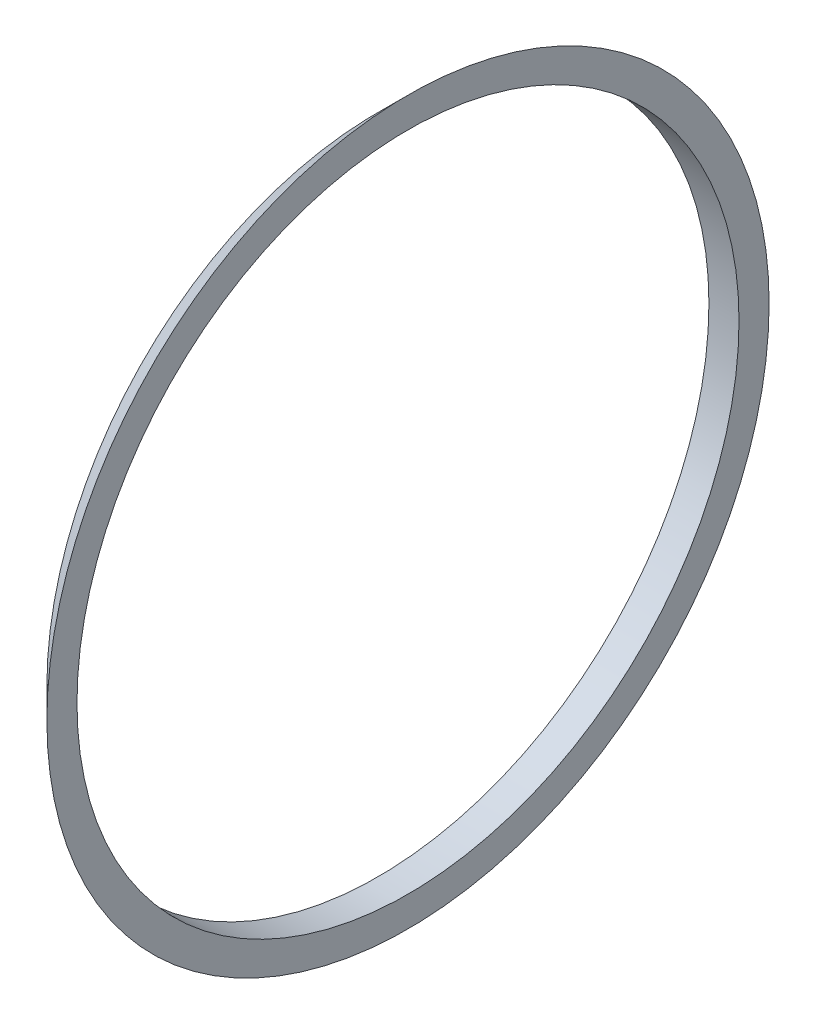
ISO-10303-21;
HEADER;
FILE_DESCRIPTION(('STEP AP214'),'2;1');
FILE_NAME('part.step','',(''),(''),'','','');
FILE_SCHEMA(('AUTOMOTIVE_DESIGN { 1 0 10303 214 1 1 1 1 }'));
ENDSEC;
DATA;
#1=APPLICATION_CONTEXT('core data for automotive mechanical design processes');
#2=APPLICATION_PROTOCOL_DEFINITION('international standard','automotive_design',2000,#1);
#3=PRODUCT_CONTEXT('',#1,'mechanical');
#4=PRODUCT('Part','Part','',(#3));
#5=PRODUCT_RELATED_PRODUCT_CATEGORY('part','',(#4));
#6=PRODUCT_DEFINITION_FORMATION('','',#4);
#7=PRODUCT_DEFINITION_CONTEXT('part definition',#1,'design');
#8=PRODUCT_DEFINITION('design','',#6,#7);
#9=PRODUCT_DEFINITION_SHAPE('','',#8);
#10=(LENGTH_UNIT() NAMED_UNIT(*) SI_UNIT(.MILLI.,.METRE.));
#11=(NAMED_UNIT(*) PLANE_ANGLE_UNIT() SI_UNIT($,.RADIAN.));
#12=(NAMED_UNIT(*) SI_UNIT($,.STERADIAN.) SOLID_ANGLE_UNIT());
#13=UNCERTAINTY_MEASURE_WITH_UNIT(LENGTH_MEASURE(1.E-05),#10,'distance_accuracy_value','');
#14=(GEOMETRIC_REPRESENTATION_CONTEXT(3) GLOBAL_UNCERTAINTY_ASSIGNED_CONTEXT((#13)) GLOBAL_UNIT_ASSIGNED_CONTEXT((#10,
#11,#12)) REPRESENTATION_CONTEXT('',''));
#15=CARTESIAN_POINT('',(0.,0.,0.));
#16=DIRECTION('',(0.,0.,1.));
#17=DIRECTION('',(1.,0.,0.));
#18=AXIS2_PLACEMENT_3D('',#15,#16,#17);
#19=CARTESIAN_POINT('',(-29.19947559,0.,0.));
#20=DIRECTION('',(1.,0.,0.));
#21=DIRECTION('',(0.,0.,-1.));
#22=AXIS2_PLACEMENT_3D('',#19,#20,#21);
#23=CONICAL_SURFACE('',#22,36.,0.785398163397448);
#24=CARTESIAN_POINT('',(-32.19947559,0.,0.));
#25=DIRECTION('',(1.,0.,0.));
#26=DIRECTION('',(0.,0.,-1.));
#27=AXIS2_PLACEMENT_3D('',#24,#25,#26);
#28=CIRCLE('',#27,33.);
#29=CARTESIAN_POINT('',(-32.19947559,0.,-33.));
#30=VERTEX_POINT('',#29);
#31=EDGE_CURVE('E39',#30,#30,#28,.T.);
#32=ORIENTED_EDGE('',*,*,#31,.T.);
#33=EDGE_LOOP('',(#32));
#34=FACE_BOUND('',#33,.T.);
#35=CARTESIAN_POINT('',(-29.19947559,0.,0.));
#36=DIRECTION('',(1.,0.,0.));
#37=DIRECTION('',(0.,0.,-1.));
#38=AXIS2_PLACEMENT_3D('',#35,#36,#37);
#39=CIRCLE('',#38,36.);
#40=CARTESIAN_POINT('',(-29.19947559,0.,-36.));
#41=VERTEX_POINT('',#40);
#42=EDGE_CURVE('E10',#41,#41,#39,.T.);
#43=ORIENTED_EDGE('',*,*,#42,.F.);
#44=EDGE_LOOP('',(#43));
#45=FACE_BOUND('',#44,.T.);
#46=ADVANCED_FACE('F29',(#34,#45),#23,.T.);
#47=CARTESIAN_POINT('',(-29.19947559,33.,0.));
#48=DIRECTION('',(1.,0.,0.));
#49=DIRECTION('',(0.,0.,-1.));
#50=AXIS2_PLACEMENT_3D('',#47,#48,#49);
#51=PLANE('',#50);
#52=ORIENTED_EDGE('',*,*,#42,.T.);
#53=EDGE_LOOP('',(#52));
#54=FACE_BOUND('',#53,.T.);
#55=CARTESIAN_POINT('',(-29.19947559,0.,0.));
#56=DIRECTION('',(1.,0.,0.));
#57=DIRECTION('',(0.,0.,-1.));
#58=AXIS2_PLACEMENT_3D('',#55,#56,#57);
#59=CIRCLE('',#58,33.);
#60=CARTESIAN_POINT('',(-29.19947559,0.,-33.));
#61=VERTEX_POINT('',#60);
#62=EDGE_CURVE('E35',#61,#61,#59,.T.);
#63=ORIENTED_EDGE('',*,*,#62,.F.);
#64=EDGE_LOOP('',(#63));
#65=FACE_BOUND('',#64,.T.);
#66=ADVANCED_FACE('F50',(#54,#65),#51,.T.);
#67=CARTESIAN_POINT('',(0.,0.,0.));
#68=DIRECTION('',(1.,0.,0.));
#69=DIRECTION('',(0.,0.,-1.));
#70=AXIS2_PLACEMENT_3D('',#67,#68,#69);
#71=CYLINDRICAL_SURFACE('',#70,33.);
#72=ORIENTED_EDGE('',*,*,#62,.T.);
#73=EDGE_LOOP('',(#72));
#74=FACE_BOUND('',#73,.T.);
#75=ORIENTED_EDGE('',*,*,#31,.F.);
#76=EDGE_LOOP('',(#75));
#77=FACE_BOUND('',#76,.T.);
#78=ADVANCED_FACE('F48',(#74,#77),#71,.F.);
#79=CLOSED_SHELL('',(#46,#66,#78));
#80=MANIFOLD_SOLID_BREP('B2',#79);
#81=ADVANCED_BREP_SHAPE_REPRESENTATION('',(#18,#80),#14);
#82=SHAPE_DEFINITION_REPRESENTATION(#9,#81);
ENDSEC;
END-ISO-10303-21;
